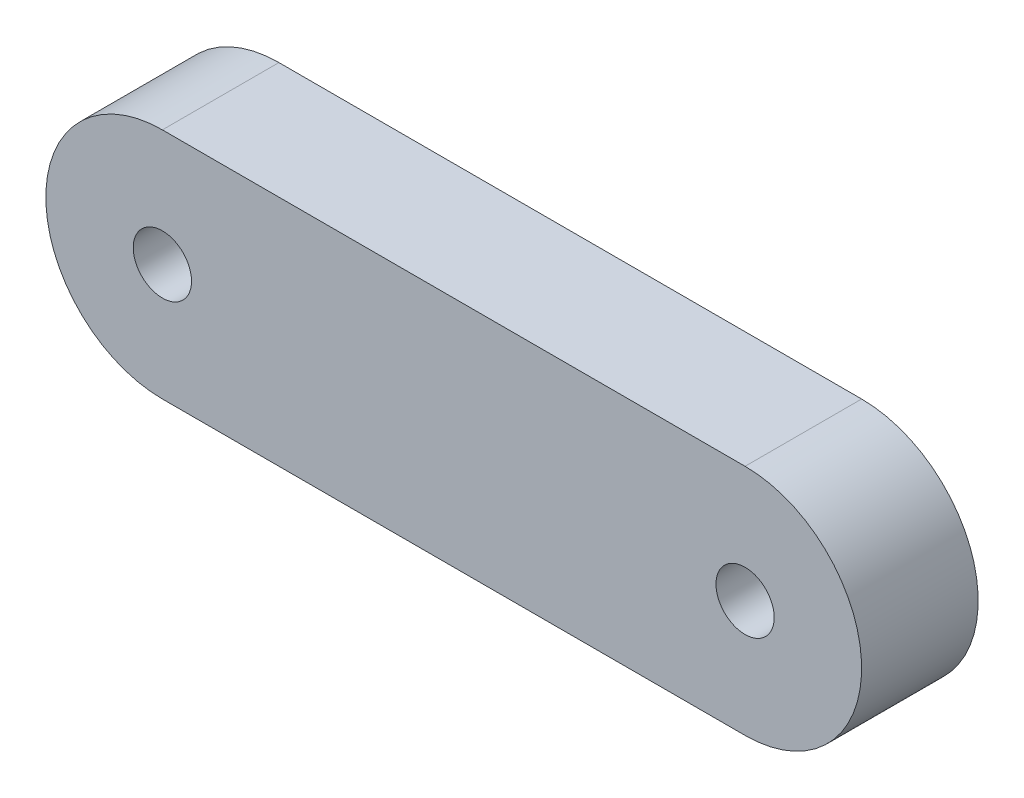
from build123d import *

# Parameters (mm, degrees)
BOSS_EXTRUDE1_DEPTH = 2.54
SKETCH2_R           = 0.635
CUT_EXTRUDE1_DEPTH  = 16.657611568


with BuildPart() as part:
    # Sketch1 → Boss-Extrude1 (new body)
    with BuildSketch(Plane.XY):
        with BuildLine():
            Line((0, 2.54), (12.7, 2.54))
            ThreePointArc((12.7, 2.54), (15.24, 0), (12.7, -2.54))
            Line((12.7, -2.54), (0, -2.54))
            ThreePointArc((0, -2.54), (-2.54, 0), (0, 2.54))
        make_face()
    extrude(amount=BOSS_EXTRUDE1_DEPTH)

    # Sketch2 → Cut-Extrude1 (cut, symmetric)
    with BuildSketch(Plane.XY.offset(2.54)):
        Circle(SKETCH2_R)
    cut_extrude1 = extrude(amount=CUT_EXTRUDE1_DEPTH, both=True, mode=Mode.SUBTRACT)

    # Mirror1: Cut-Extrude1 across plane
    add(cut_extrude1.mirror(Plane(origin=(6.35, 0, 0), x_dir=(0, 0, 1), z_dir=(1, 0, 0))), mode=Mode.SUBTRACT)


solid = part.part
